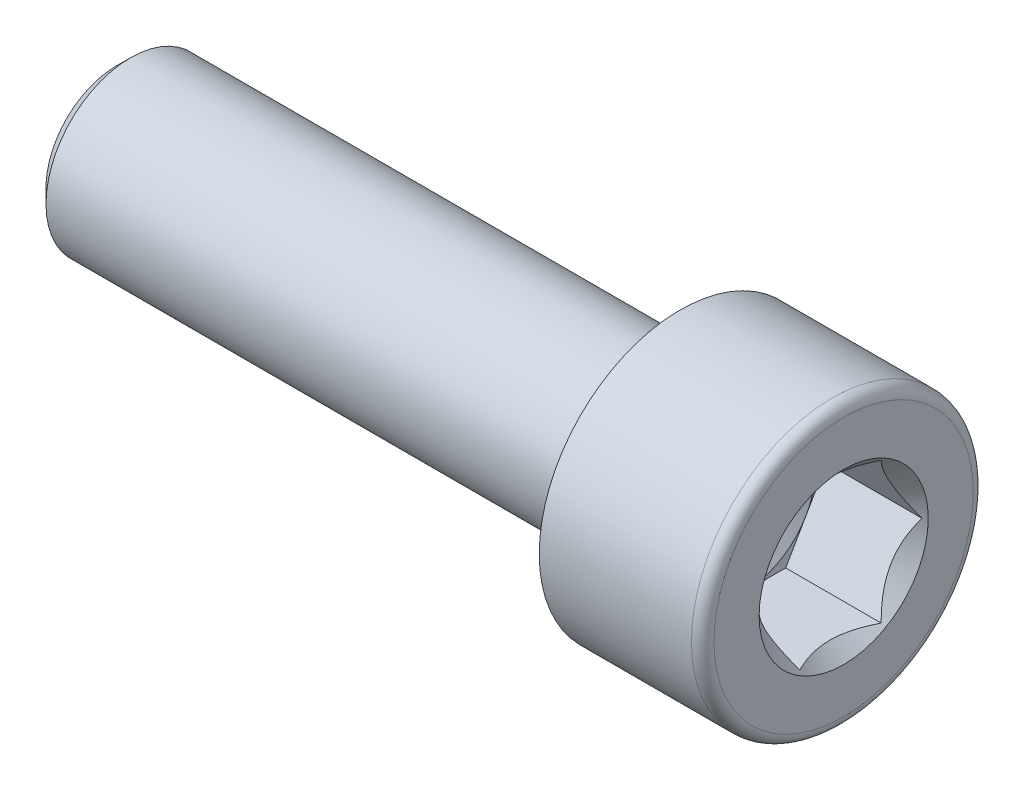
ISO-10303-21;
HEADER;
FILE_DESCRIPTION(('STEP AP214'),'2;1');
FILE_NAME('part.step','',(''),(''),'','','');
FILE_SCHEMA(('AUTOMOTIVE_DESIGN { 1 0 10303 214 1 1 1 1 }'));
ENDSEC;
DATA;
#1=APPLICATION_CONTEXT('core data for automotive mechanical design processes');
#2=APPLICATION_PROTOCOL_DEFINITION('international standard','automotive_design',2000,#1);
#3=PRODUCT_CONTEXT('',#1,'mechanical');
#4=PRODUCT('Part','Part','',(#3));
#5=PRODUCT_RELATED_PRODUCT_CATEGORY('part','',(#4));
#6=PRODUCT_DEFINITION_FORMATION('','',#4);
#7=PRODUCT_DEFINITION_CONTEXT('part definition',#1,'design');
#8=PRODUCT_DEFINITION('design','',#6,#7);
#9=PRODUCT_DEFINITION_SHAPE('','',#8);
#10=(LENGTH_UNIT() NAMED_UNIT(*) SI_UNIT(.MILLI.,.METRE.));
#11=(NAMED_UNIT(*) PLANE_ANGLE_UNIT() SI_UNIT($,.RADIAN.));
#12=(NAMED_UNIT(*) SI_UNIT($,.STERADIAN.) SOLID_ANGLE_UNIT());
#13=UNCERTAINTY_MEASURE_WITH_UNIT(LENGTH_MEASURE(1.E-05),#10,'distance_accuracy_value','');
#14=(GEOMETRIC_REPRESENTATION_CONTEXT(3) GLOBAL_UNCERTAINTY_ASSIGNED_CONTEXT((#13)) GLOBAL_UNIT_ASSIGNED_CONTEXT((#10,
#11,#12)) REPRESENTATION_CONTEXT('',''));
#15=CARTESIAN_POINT('',(0.,0.,0.));
#16=DIRECTION('',(0.,0.,1.));
#17=DIRECTION('',(1.,0.,0.));
#18=AXIS2_PLACEMENT_3D('',#15,#16,#17);
#19=CARTESIAN_POINT('',(-30.,0.,0.));
#20=DIRECTION('',(-1.,0.,0.));
#21=DIRECTION('',(0.,0.,1.));
#22=AXIS2_PLACEMENT_3D('',#19,#20,#21);
#23=CYLINDRICAL_SURFACE('',#22,3.);
#24=CARTESIAN_POINT('',(-19.5000000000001,0.,0.));
#25=DIRECTION('',(1.,0.,0.));
#26=DIRECTION('',(0.,0.,-1.));
#27=AXIS2_PLACEMENT_3D('',#24,#25,#26);
#28=CIRCLE('',#27,3.);
#29=CARTESIAN_POINT('',(-19.5000000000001,0.,-3.));
#30=VERTEX_POINT('',#29);
#31=EDGE_CURVE('E11',#30,#30,#28,.T.);
#32=ORIENTED_EDGE('',*,*,#31,.T.);
#33=EDGE_LOOP('',(#32));
#34=FACE_BOUND('',#33,.T.);
#35=CARTESIAN_POINT('',(0.,0.,0.));
#36=DIRECTION('',(-1.,0.,0.));
#37=DIRECTION('',(0.,0.,1.));
#38=AXIS2_PLACEMENT_3D('',#35,#36,#37);
#39=CIRCLE('',#38,3.);
#40=CARTESIAN_POINT('',(0.,0.,3.));
#41=VERTEX_POINT('',#40);
#42=EDGE_CURVE('E461',#41,#41,#39,.T.);
#43=ORIENTED_EDGE('',*,*,#42,.T.);
#44=EDGE_LOOP('',(#43));
#45=FACE_BOUND('',#44,.T.);
#46=ADVANCED_FACE('F348',(#34,#45),#23,.T.);
#47=CARTESIAN_POINT('',(-20.,0.,0.));
#48=DIRECTION('',(1.,0.,0.));
#49=DIRECTION('',(0.,0.,-1.));
#50=AXIS2_PLACEMENT_3D('',#47,#48,#49);
#51=PLANE('',#50);
#52=CARTESIAN_POINT('',(-20.,0.,0.));
#53=DIRECTION('',(1.,0.,0.));
#54=DIRECTION('',(0.,0.,-1.));
#55=AXIS2_PLACEMENT_3D('',#52,#53,#54);
#56=CIRCLE('',#55,2.5);
#57=CARTESIAN_POINT('',(-20.,0.,-2.5));
#58=VERTEX_POINT('',#57);
#59=EDGE_CURVE('E355',#58,#58,#56,.F.);
#60=ORIENTED_EDGE('',*,*,#59,.T.);
#61=EDGE_LOOP('',(#60));
#62=FACE_BOUND('',#61,.T.);
#63=ADVANCED_FACE('F535',(#62),#51,.F.);
#64=CARTESIAN_POINT('',(5.30000000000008,0.,0.));
#65=DIRECTION('',(1.,0.,0.));
#66=DIRECTION('',(0.,0.,-1.));
#67=AXIS2_PLACEMENT_3D('',#64,#65,#66);
#68=CONICAL_SURFACE('',#67,2.5,0.785398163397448);
#69=CARTESIAN_POINT('',(5.80000000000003,0.,0.));
#70=DIRECTION('',(-1.,0.,0.));
#71=DIRECTION('',(0.,0.,1.));
#72=AXIS2_PLACEMENT_3D('',#69,#70,#71);
#73=CIRCLE('',#72,3.);
#74=CARTESIAN_POINT('',(5.80000000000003,0.,3.));
#75=VERTEX_POINT('',#74);
#76=EDGE_CURVE('E484',#75,#75,#73,.T.);
#77=ORIENTED_EDGE('',*,*,#76,.F.);
#78=EDGE_LOOP('',(#77));
#79=FACE_BOUND('',#78,.T.);
#80=CARTESIAN_POINT('',(5.68686682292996,-2.50020000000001,1.44326020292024));
#81=CARTESIAN_POINT('',(5.63729205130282,-2.41426172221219,1.49287669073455));
#82=CARTESIAN_POINT('',(5.59062882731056,-2.32688643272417,1.54332283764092));
#83=CARTESIAN_POINT('',(5.50518948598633,-2.14871854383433,1.6461881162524));
#84=CARTESIAN_POINT('',(5.46646090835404,-2.05790899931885,1.69861703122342));
#85=CARTESIAN_POINT('',(5.40011804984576,-1.874795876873,1.80433744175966));
#86=CARTESIAN_POINT('',(5.37233701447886,-1.78253893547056,1.85760201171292));
#87=CARTESIAN_POINT('',(5.32953452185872,-1.59599399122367,1.96530378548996));
#88=CARTESIAN_POINT('',(5.31448111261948,-1.50171168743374,2.01973769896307));
#89=CARTESIAN_POINT('',(5.30089906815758,-1.33922174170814,2.11355131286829));
#90=CARTESIAN_POINT('',(5.29888844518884,-1.27122403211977,2.15280980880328));
#91=CARTESIAN_POINT('',(5.30227546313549,-1.13533975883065,2.23126263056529));
#92=CARTESIAN_POINT('',(5.30767570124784,-1.06745324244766,2.27045692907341));
#93=CARTESIAN_POINT('',(5.32557713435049,-0.932321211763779,2.34847544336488));
#94=CARTESIAN_POINT('',(5.33808627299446,-0.865076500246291,2.38729919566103));
#95=CARTESIAN_POINT('',(5.36951884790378,-0.731749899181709,2.46427534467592));
#96=CARTESIAN_POINT('',(5.38844179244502,-0.66566792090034,2.50242779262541));
#97=CARTESIAN_POINT('',(5.44461870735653,-0.496403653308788,2.60015256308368));
#98=CARTESIAN_POINT('',(5.48610717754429,-0.394270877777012,2.65911894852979));
#99=CARTESIAN_POINT('',(5.55614539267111,-0.244093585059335,2.7458238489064));
#100=CARTESIAN_POINT('',(5.5807535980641,-0.194603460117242,2.77439698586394));
#101=CARTESIAN_POINT('',(5.63221323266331,-0.0965399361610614,2.8310139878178));
#102=CARTESIAN_POINT('',(5.65906328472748,-0.0479659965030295,2.85905816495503));
#103=CARTESIAN_POINT('',(5.68686682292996,0.000199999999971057,2.88686681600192));
#104=B_SPLINE_CURVE_WITH_KNOTS('',3,(#80,#81,#82,#83,#84,#85,#86,#87,#88,#89,#90,#91,#92,#93,
#94,#95,#96,#97,#98,#99,#100,#101,#102,#103),.UNSPECIFIED.,.F.,.F.,(4,2,2,2,2,2,2,2,2,2,2,4),
(0.,0.333012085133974,0.667964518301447,0.997597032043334,1.32639954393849,1.56169424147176,
1.7970714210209,2.03271213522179,2.26833478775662,2.64260240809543,2.82922877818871,
3.01574133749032),.UNSPECIFIED.);
#105=CARTESIAN_POINT('',(5.6867513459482,-2.50000000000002,1.44337567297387));
#106=VERTEX_POINT('',#105);
#107=CARTESIAN_POINT('',(5.6867513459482,0.,2.8867513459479));
#108=VERTEX_POINT('',#107);
#109=EDGE_CURVE('E489',#106,#108,#104,.T.);
#110=ORIENTED_EDGE('',*,*,#109,.T.);
#111=CARTESIAN_POINT('',(5.68686682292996,-0.000199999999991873,2.88686681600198));
#112=CARTESIAN_POINT('',(5.63729205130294,0.085738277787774,2.83725032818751));
#113=CARTESIAN_POINT('',(5.59062882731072,0.173113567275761,2.78680418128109));
#114=CARTESIAN_POINT('',(5.5051894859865,0.351281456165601,2.68393890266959));
#115=CARTESIAN_POINT('',(5.4664609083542,0.442091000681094,2.63150998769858));
#116=CARTESIAN_POINT('',(5.40011804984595,0.625204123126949,2.52578957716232));
#117=CARTESIAN_POINT('',(5.37233701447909,0.71746106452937,2.47252500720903));
#118=CARTESIAN_POINT('',(5.32953452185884,0.904006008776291,2.36482323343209));
#119=CARTESIAN_POINT('',(5.31448111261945,0.998288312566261,2.3103893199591));
#120=CARTESIAN_POINT('',(5.30089906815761,1.16077825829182,2.21657570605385));
#121=CARTESIAN_POINT('',(5.29888844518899,1.22877596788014,2.17731721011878));
#122=CARTESIAN_POINT('',(5.30227546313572,1.36466024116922,2.0988643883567));
#123=CARTESIAN_POINT('',(5.30767570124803,1.43254675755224,2.05967008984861));
#124=CARTESIAN_POINT('',(5.32557713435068,1.56767878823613,1.98165157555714));
#125=CARTESIAN_POINT('',(5.33808627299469,1.6349234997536,1.94282782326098));
#126=CARTESIAN_POINT('',(5.36951884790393,1.76825010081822,1.86585167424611));
#127=CARTESIAN_POINT('',(5.38844179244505,1.83433207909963,1.82769922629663));
#128=CARTESIAN_POINT('',(5.44461870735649,2.00359634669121,1.72997445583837));
#129=CARTESIAN_POINT('',(5.48610717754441,2.10572912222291,1.67100807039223));
#130=CARTESIAN_POINT('',(5.55614539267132,2.25590641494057,1.58430317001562));
#131=CARTESIAN_POINT('',(5.58075359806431,2.30539653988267,1.55573003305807));
#132=CARTESIAN_POINT('',(5.63221323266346,2.40346006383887,1.4991130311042));
#133=CARTESIAN_POINT('',(5.65906328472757,2.45203400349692,1.47106885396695));
#134=CARTESIAN_POINT('',(5.68686682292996,2.50019999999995,1.44326020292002));
#135=B_SPLINE_CURVE_WITH_KNOTS('',3,(#111,#112,#113,#114,#115,#116,#117,#118,#119,#120,#121,
#122,#123,#124,#125,#126,#127,#128,#129,#130,#131,#132,#133,#134),.UNSPECIFIED.,.F.,.F.,(4,2,2,
2,2,2,2,2,2,2,2,4),(0.,0.333012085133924,0.667964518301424,0.997597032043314,1.32639954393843,
1.56169424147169,1.79707142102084,2.03271213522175,2.26833478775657,2.64260240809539,
2.82922877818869,3.0157413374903),.UNSPECIFIED.);
#136=CARTESIAN_POINT('',(5.6867513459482,2.49999999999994,1.44337567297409));
#137=VERTEX_POINT('',#136);
#138=EDGE_CURVE('E370',#108,#137,#135,.T.);
#139=ORIENTED_EDGE('',*,*,#138,.T.);
#140=CARTESIAN_POINT('',(6.74994835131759,2.49999999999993,-3.05811902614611));
#141=CARTESIAN_POINT('',(6.69289416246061,2.49999999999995,-2.98440983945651));
#142=CARTESIAN_POINT('',(6.636338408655,2.49999999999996,-2.91030875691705));
#143=CARTESIAN_POINT('',(6.52445299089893,2.49999999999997,-2.76116077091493));
#144=CARTESIAN_POINT('',(6.4691236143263,2.49999999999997,-2.6861136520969));
#145=CARTESIAN_POINT('',(6.35952665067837,2.49999999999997,-2.53436379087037));
#146=CARTESIAN_POINT('',(6.30527051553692,2.49999999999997,-2.4576527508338));
#147=CARTESIAN_POINT('',(6.19860260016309,2.49999999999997,-2.30296317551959));
#148=CARTESIAN_POINT('',(6.14619069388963,2.49999999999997,-2.22498472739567));
#149=CARTESIAN_POINT('',(6.04026321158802,2.49999999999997,-2.06236769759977));
#150=CARTESIAN_POINT('',(5.98690162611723,2.49999999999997,-1.97762830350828));
#151=CARTESIAN_POINT('',(5.88344307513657,2.49999999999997,-1.80618229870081));
#152=CARTESIAN_POINT('',(5.83334568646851,2.49999999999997,-1.71947594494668));
#153=CARTESIAN_POINT('',(5.73745253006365,2.49999999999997,-1.54402392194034));
#154=CARTESIAN_POINT('',(5.69164475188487,2.49999999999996,-1.45528486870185));
#155=CARTESIAN_POINT('',(5.60536574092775,2.49999999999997,-1.27526975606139));
#156=CARTESIAN_POINT('',(5.56489195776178,2.49999999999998,-1.18399493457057));
#157=CARTESIAN_POINT('',(5.49462825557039,2.49999999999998,-1.00836471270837));
#158=CARTESIAN_POINT('',(5.46416406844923,2.49999999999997,-0.924281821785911));
#159=CARTESIAN_POINT('',(5.4099624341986,2.49999999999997,-0.753934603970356));
#160=CARTESIAN_POINT('',(5.38622540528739,2.49999999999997,-0.667670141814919));
#161=CARTESIAN_POINT('',(5.34717521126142,2.49999999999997,-0.495001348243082));
#162=CARTESIAN_POINT('',(5.33170602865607,2.49999999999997,-0.408632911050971));
#163=CARTESIAN_POINT('',(5.30952108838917,2.49999999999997,-0.23477275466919));
#164=CARTESIAN_POINT('',(5.30280339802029,2.49999999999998,-0.147281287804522));
#165=CARTESIAN_POINT('',(5.29871822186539,2.49999999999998,0.0238518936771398));
#166=CARTESIAN_POINT('',(5.30093086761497,2.49999999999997,0.107483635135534));
#167=CARTESIAN_POINT('',(5.31360968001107,2.49999999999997,0.274114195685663));
#168=CARTESIAN_POINT('',(5.32407657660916,2.49999999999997,0.357112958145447));
#169=CARTESIAN_POINT('',(5.35284213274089,2.49999999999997,0.523288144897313));
#170=CARTESIAN_POINT('',(5.37128080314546,2.49999999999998,0.606439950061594));
#171=CARTESIAN_POINT('',(5.41495620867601,2.49999999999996,0.770896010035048));
#172=CARTESIAN_POINT('',(5.44019262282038,2.49999999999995,0.852200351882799));
#173=CARTESIAN_POINT('',(5.52700067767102,2.49999999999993,1.10064624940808));
#174=CARTESIAN_POINT('',(5.59813375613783,2.49999999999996,1.26445670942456));
#175=CARTESIAN_POINT('',(5.71682012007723,2.49999999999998,1.50421272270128));
#176=CARTESIAN_POINT('',(5.75847161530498,2.49999999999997,1.5832841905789));
#177=CARTESIAN_POINT('',(5.84501240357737,2.49999999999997,1.73963927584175));
#178=CARTESIAN_POINT('',(5.88990113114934,2.49999999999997,1.81692320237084));
#179=CARTESIAN_POINT('',(5.97999121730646,2.49999999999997,1.96613896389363));
#180=CARTESIAN_POINT('',(6.02506807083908,2.49999999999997,2.03814682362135));
#181=CARTESIAN_POINT('',(6.11714731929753,2.49999999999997,2.18092679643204));
#182=CARTESIAN_POINT('',(6.16414985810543,2.49999999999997,2.25169881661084));
#183=CARTESIAN_POINT('',(6.25935501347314,2.49999999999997,2.39159945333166));
#184=CARTESIAN_POINT('',(6.30754501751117,2.49999999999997,2.46073668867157));
#185=CARTESIAN_POINT('',(6.40522114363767,2.49999999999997,2.5980618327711));
#186=CARTESIAN_POINT('',(6.45470690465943,2.49999999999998,2.666249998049));
#187=CARTESIAN_POINT('',(6.50472334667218,2.49999999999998,2.73404006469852));
#188=B_SPLINE_CURVE_WITH_KNOTS('',3,(#140,#141,#142,#143,#144,#145,#146,#147,#148,#149,#150,
#151,#152,#153,#154,#155,#156,#157,#158,#159,#160,#161,#162,#163,#164,#165,#166,#167,#168,#169,
#170,#171,#172,#173,#174,#175,#176,#177,#178,#179,#180,#181,#182,#183,#184,#185,#186,#187),
.UNSPECIFIED.,.F.,.F.,(4,2,2,2,2,2,2,2,2,2,2,2,2,2,2,2,2,2,2,2,2,2,2,4),(0.,0.279636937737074,
0.55933872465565,0.841193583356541,1.12302914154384,1.42339426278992,1.7237203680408,
2.02317874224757,2.32249341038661,2.5905581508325,2.85863955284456,3.12146553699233,
3.38423346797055,3.63479445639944,3.88537760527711,4.14055298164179,4.39571631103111,
4.92983151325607,5.1979207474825,5.46596326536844,5.72079181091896,5.97563943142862,
6.22844778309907,6.48118642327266),.UNSPECIFIED.);
#189=CARTESIAN_POINT('',(5.6867513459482,2.49999999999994,-1.4433756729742));
#190=VERTEX_POINT('',#189);
#191=EDGE_CURVE('E526',#137,#190,#188,.F.);
#192=ORIENTED_EDGE('',*,*,#191,.T.);
#193=CARTESIAN_POINT('',(5.68686682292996,2.50019999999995,-1.44326020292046));
#194=CARTESIAN_POINT('',(5.63729205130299,2.41426172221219,-1.4928766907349));
#195=CARTESIAN_POINT('',(5.59062882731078,2.32688643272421,-1.54332283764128));
#196=CARTESIAN_POINT('',(5.50518948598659,2.1487185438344,-1.64618811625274));
#197=CARTESIAN_POINT('',(5.46646090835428,2.05790899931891,-1.69861703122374));
#198=CARTESIAN_POINT('',(5.40011804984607,1.87479587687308,-1.80433744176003));
#199=CARTESIAN_POINT('',(5.37233701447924,1.78253893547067,-1.85760201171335));
#200=CARTESIAN_POINT('',(5.32953452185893,1.59599399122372,-1.96530378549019));
#201=CARTESIAN_POINT('',(5.31448111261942,1.50171168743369,-2.01973769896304));
#202=CARTESIAN_POINT('',(5.30089906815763,1.33922174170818,-2.11355131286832));
#203=CARTESIAN_POINT('',(5.2988884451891,1.27122403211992,-2.15280980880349));
#204=CARTESIAN_POINT('',(5.30227546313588,1.13533975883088,-2.23126263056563));
#205=CARTESIAN_POINT('',(5.30767570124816,1.06745324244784,-2.27045692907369));
#206=CARTESIAN_POINT('',(5.32557713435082,0.932321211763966,-2.34847544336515));
#207=CARTESIAN_POINT('',(5.33808627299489,0.865076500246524,-2.38729919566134));
#208=CARTESIAN_POINT('',(5.36951884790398,0.731749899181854,-2.46427534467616));
#209=CARTESIAN_POINT('',(5.38844179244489,0.665667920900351,-2.50242779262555));
#210=CARTESIAN_POINT('',(5.44461870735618,0.496403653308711,-2.60015256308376));
#211=CARTESIAN_POINT('',(5.48610717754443,0.394270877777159,-2.65911894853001));
#212=CARTESIAN_POINT('',(5.55614539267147,0.244093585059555,-2.74582384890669));
#213=CARTESIAN_POINT('',(5.58075359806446,0.194603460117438,-2.77439698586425));
#214=CARTESIAN_POINT('',(5.63221323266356,0.0965399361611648,-2.83101398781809));
#215=CARTESIAN_POINT('',(5.65906328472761,0.0479659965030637,-2.85905816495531));
#216=CARTESIAN_POINT('',(5.68686682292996,-0.000200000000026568,-2.8868668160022));
#217=B_SPLINE_CURVE_WITH_KNOTS('',3,(#193,#194,#195,#196,#197,#198,#199,#200,#201,#202,#203,
#204,#205,#206,#207,#208,#209,#210,#211,#212,#213,#214,#215,#216),.UNSPECIFIED.,.F.,.F.,(4,2,2,
2,2,2,2,2,2,2,2,4),(0.,0.333012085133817,0.667964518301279,0.997597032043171,1.32639954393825,
1.56169424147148,1.79707142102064,2.03271213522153,2.2683347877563,2.64260240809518,
2.82922877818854,3.01574133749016),.UNSPECIFIED.);
#218=CARTESIAN_POINT('',(5.6867513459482,0.,-2.88675134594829));
#219=VERTEX_POINT('',#218);
#220=EDGE_CURVE('E609',#190,#219,#217,.T.);
#221=ORIENTED_EDGE('',*,*,#220,.T.);
#222=CARTESIAN_POINT('',(5.68686682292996,0.000199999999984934,-2.88686681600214));
#223=CARTESIAN_POINT('',(5.63729205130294,-0.0857382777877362,-2.83725032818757));
#224=CARTESIAN_POINT('',(5.59062882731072,-0.173113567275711,-2.78680418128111));
#225=CARTESIAN_POINT('',(5.5051894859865,-0.351281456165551,-2.68393890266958));
#226=CARTESIAN_POINT('',(5.46646090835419,-0.442091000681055,-2.63150998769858));
#227=CARTESIAN_POINT('',(5.40011804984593,-0.625204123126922,-2.52578957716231));
#228=CARTESIAN_POINT('',(5.37233701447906,-0.717461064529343,-2.47252500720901));
#229=CARTESIAN_POINT('',(5.32953452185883,-0.904006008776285,-2.36482323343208));
#230=CARTESIAN_POINT('',(5.31448111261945,-0.998288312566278,-2.31038931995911));
#231=CARTESIAN_POINT('',(5.30089906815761,-1.16077825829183,-2.21657570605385));
#232=CARTESIAN_POINT('',(5.29888844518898,-1.22877596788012,-2.17731721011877));
#233=CARTESIAN_POINT('',(5.3022754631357,-1.36466024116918,-2.0988643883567));
#234=CARTESIAN_POINT('',(5.30767570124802,-1.43254675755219,-2.05967008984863));
#235=CARTESIAN_POINT('',(5.32557713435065,-1.56767878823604,-1.98165157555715));
#236=CARTESIAN_POINT('',(5.33808627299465,-1.63492349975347,-1.94282782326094));
#237=CARTESIAN_POINT('',(5.3695188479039,-1.76825010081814,-1.86585167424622));
#238=CARTESIAN_POINT('',(5.38844179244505,-1.83433207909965,-1.82769922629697));
#239=CARTESIAN_POINT('',(5.4446187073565,-2.00359634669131,-1.72997445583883));
#240=CARTESIAN_POINT('',(5.48610717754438,-2.10572912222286,-1.67100807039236));
#241=CARTESIAN_POINT('',(5.55614539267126,-2.25590641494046,-1.58430317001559));
#242=CARTESIAN_POINT('',(5.58075359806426,-2.30539653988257,-1.55573003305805));
#243=CARTESIAN_POINT('',(5.63221323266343,-2.40346006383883,-1.49911303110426));
#244=CARTESIAN_POINT('',(5.65906328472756,-2.45203400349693,-1.47106885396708));
#245=CARTESIAN_POINT('',(5.68686682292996,-2.50020000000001,-1.44326020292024));
#246=B_SPLINE_CURVE_WITH_KNOTS('',3,(#222,#223,#224,#225,#226,#227,#228,#229,#230,#231,#232,
#233,#234,#235,#236,#237,#238,#239,#240,#241,#242,#243,#244,#245),.UNSPECIFIED.,.F.,.F.,(4,2,2,
2,2,2,2,2,2,2,2,4),(0.,0.333012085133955,0.667964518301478,0.997597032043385,1.32639954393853,
1.56169424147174,1.79707142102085,2.03271213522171,2.26833478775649,2.64260240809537,
2.82922877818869,3.01574133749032),.UNSPECIFIED.);
#247=CARTESIAN_POINT('',(5.6867513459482,-2.50000000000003,-1.44337567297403));
#248=VERTEX_POINT('',#247);
#249=EDGE_CURVE('E610',#219,#248,#246,.T.);
#250=ORIENTED_EDGE('',*,*,#249,.T.);
#251=CARTESIAN_POINT('',(6.74994835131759,-2.49999999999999,-3.05811902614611));
#252=CARTESIAN_POINT('',(6.69289416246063,-2.50000000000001,-2.98440983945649));
#253=CARTESIAN_POINT('',(6.63633840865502,-2.50000000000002,-2.91030875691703));
#254=CARTESIAN_POINT('',(6.52445299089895,-2.50000000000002,-2.7611607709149));
#255=CARTESIAN_POINT('',(6.46912361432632,-2.50000000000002,-2.68611365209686));
#256=CARTESIAN_POINT('',(6.35952665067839,-2.50000000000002,-2.53436379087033));
#257=CARTESIAN_POINT('',(6.30527051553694,-2.50000000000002,-2.45765275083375));
#258=CARTESIAN_POINT('',(6.1986026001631,-2.50000000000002,-2.30296317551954));
#259=CARTESIAN_POINT('',(6.14619069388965,-2.50000000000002,-2.22498472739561));
#260=CARTESIAN_POINT('',(6.04026321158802,-2.50000000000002,-2.0623676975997));
#261=CARTESIAN_POINT('',(5.98690162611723,-2.50000000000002,-1.9776283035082));
#262=CARTESIAN_POINT('',(5.88344307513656,-2.50000000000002,-1.80618229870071));
#263=CARTESIAN_POINT('',(5.8333456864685,-2.50000000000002,-1.71947594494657));
#264=CARTESIAN_POINT('',(5.73745253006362,-2.50000000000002,-1.5440239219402));
#265=CARTESIAN_POINT('',(5.69164475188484,-2.50000000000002,-1.45528486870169));
#266=CARTESIAN_POINT('',(5.60536574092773,-2.50000000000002,-1.27526975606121));
#267=CARTESIAN_POINT('',(5.56489195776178,-2.50000000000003,-1.18399493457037));
#268=CARTESIAN_POINT('',(5.4946282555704,-2.50000000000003,-1.00836471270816));
#269=CARTESIAN_POINT('',(5.46416406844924,-2.50000000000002,-0.924281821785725));
#270=CARTESIAN_POINT('',(5.4099624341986,-2.50000000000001,-0.753934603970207));
#271=CARTESIAN_POINT('',(5.38622540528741,-2.50000000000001,-0.667670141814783));
#272=CARTESIAN_POINT('',(5.34717521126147,-2.50000000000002,-0.495001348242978));
#273=CARTESIAN_POINT('',(5.33170602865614,-2.50000000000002,-0.408632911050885));
#274=CARTESIAN_POINT('',(5.30952108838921,-2.50000000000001,-0.234772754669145));
#275=CARTESIAN_POINT('',(5.30280339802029,-2.49999999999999,-0.1472812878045));
#276=CARTESIAN_POINT('',(5.29871822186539,-2.5,0.023851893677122));
#277=CARTESIAN_POINT('',(5.30093086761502,-2.50000000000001,0.1074836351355));
#278=CARTESIAN_POINT('',(5.31360968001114,-2.50000000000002,0.274114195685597));
#279=CARTESIAN_POINT('',(5.32407657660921,-2.50000000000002,0.357112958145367));
#280=CARTESIAN_POINT('',(5.35284213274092,-2.50000000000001,0.523288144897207));
#281=CARTESIAN_POINT('',(5.37128080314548,-2.50000000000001,0.606439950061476));
#282=CARTESIAN_POINT('',(5.41495620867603,-2.50000000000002,0.770896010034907));
#283=CARTESIAN_POINT('',(5.44019262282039,-2.50000000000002,0.852200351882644));
#284=CARTESIAN_POINT('',(5.52700067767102,-2.50000000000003,1.10064624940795));
#285=CARTESIAN_POINT('',(5.59813375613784,-2.50000000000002,1.26445670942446));
#286=CARTESIAN_POINT('',(5.71682012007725,-2.50000000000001,1.50421272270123));
#287=CARTESIAN_POINT('',(5.75847161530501,-2.50000000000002,1.58328419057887));
#288=CARTESIAN_POINT('',(5.84501240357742,-2.50000000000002,1.73963927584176));
#289=CARTESIAN_POINT('',(5.8899011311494,-2.50000000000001,1.81692320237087));
#290=CARTESIAN_POINT('',(5.97999121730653,-2.50000000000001,1.96613896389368));
#291=CARTESIAN_POINT('',(6.02506807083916,-2.50000000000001,2.03814682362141));
#292=CARTESIAN_POINT('',(6.11714731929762,-2.50000000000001,2.18092679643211));
#293=CARTESIAN_POINT('',(6.16414985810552,-2.50000000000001,2.25169881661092));
#294=CARTESIAN_POINT('',(6.25935501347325,-2.50000000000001,2.39159945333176));
#295=CARTESIAN_POINT('',(6.30754501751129,-2.50000000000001,2.46073668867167));
#296=CARTESIAN_POINT('',(6.40522114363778,-2.50000000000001,2.59806183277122));
#297=CARTESIAN_POINT('',(6.45470690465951,-2.50000000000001,2.66624999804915));
#298=CARTESIAN_POINT('',(6.50472334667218,-2.50000000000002,2.73404006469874));
#299=B_SPLINE_CURVE_WITH_KNOTS('',3,(#251,#252,#253,#254,#255,#256,#257,#258,#259,#260,#261,
#262,#263,#264,#265,#266,#267,#268,#269,#270,#271,#272,#273,#274,#275,#276,#277,#278,#279,#280,
#281,#282,#283,#284,#285,#286,#287,#288,#289,#290,#291,#292,#293,#294,#295,#296,#297,#298),
.UNSPECIFIED.,.F.,.F.,(4,2,2,2,2,2,2,2,2,2,2,2,2,2,2,2,2,2,2,2,2,2,2,4),(0.,0.279636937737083,
0.559338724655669,0.841193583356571,1.12302914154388,1.42339426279,1.72372036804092,
2.02317874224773,2.3224934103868,2.59055815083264,2.85863955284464,3.12146553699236,
3.38423346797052,3.63479445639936,3.88537760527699,4.14055298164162,4.3957163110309,
4.92983151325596,5.19792074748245,5.46596326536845,5.720791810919,5.97563943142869,
6.22844778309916,6.48118642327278),.UNSPECIFIED.);
#300=EDGE_CURVE('E497',#248,#106,#299,.T.);
#301=ORIENTED_EDGE('',*,*,#300,.T.);
#302=EDGE_LOOP('',(#110,#139,#192,#221,#250,#301));
#303=FACE_BOUND('',#302,.T.);
#304=ADVANCED_FACE('F503',(#79,#303),#68,.F.);
#305=CARTESIAN_POINT('',(5.80000000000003,4.59999999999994,-2.22044604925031E-13));
#306=DIRECTION('',(-1.,0.,0.));
#307=DIRECTION('',(0.,0.,1.));
#308=AXIS2_PLACEMENT_3D('',#305,#306,#307);
#309=PLANE('',#308);
#310=CARTESIAN_POINT('',(5.80000000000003,0.,0.));
#311=DIRECTION('',(-1.,0.,0.));
#312=DIRECTION('',(0.,0.,1.));
#313=AXIS2_PLACEMENT_3D('',#310,#311,#312);
#314=CIRCLE('',#313,4.6);
#315=CARTESIAN_POINT('',(5.80000000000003,0.,4.6));
#316=VERTEX_POINT('',#315);
#317=EDGE_CURVE('E481',#316,#316,#314,.T.);
#318=ORIENTED_EDGE('',*,*,#317,.F.);
#319=EDGE_LOOP('',(#318));
#320=FACE_BOUND('',#319,.T.);
#321=ORIENTED_EDGE('',*,*,#76,.T.);
#322=EDGE_LOOP('',(#321));
#323=FACE_BOUND('',#322,.T.);
#324=ADVANCED_FACE('F568',(#320,#323),#309,.F.);
#325=CARTESIAN_POINT('',(5.40000000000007,0.,0.));
#326=DIRECTION('',(-1.,0.,0.));
#327=DIRECTION('',(0.,0.,1.));
#328=AXIS2_PLACEMENT_3D('',#325,#326,#327);
#329=TOROIDAL_SURFACE('',#328,4.6,0.4);
#330=CARTESIAN_POINT('',(5.40000000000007,0.,0.));
#331=DIRECTION('',(-1.,0.,0.));
#332=DIRECTION('',(0.,0.,1.));
#333=AXIS2_PLACEMENT_3D('',#330,#331,#332);
#334=CIRCLE('',#333,5.);
#335=CARTESIAN_POINT('',(5.40000000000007,0.,5.));
#336=VERTEX_POINT('',#335);
#337=EDGE_CURVE('E478',#336,#336,#334,.T.);
#338=ORIENTED_EDGE('',*,*,#337,.F.);
#339=EDGE_LOOP('',(#338));
#340=FACE_BOUND('',#339,.T.);
#341=ORIENTED_EDGE('',*,*,#317,.T.);
#342=EDGE_LOOP('',(#341));
#343=FACE_BOUND('',#342,.T.);
#344=ADVANCED_FACE('F563',(#340,#343),#329,.T.);
#345=CARTESIAN_POINT('',(-30.,0.,0.));
#346=DIRECTION('',(-1.,0.,0.));
#347=DIRECTION('',(0.,0.,1.));
#348=AXIS2_PLACEMENT_3D('',#345,#346,#347);
#349=CYLINDRICAL_SURFACE('',#348,5.);
#350=CARTESIAN_POINT('',(0.,0.,0.));
#351=DIRECTION('',(-1.,0.,0.));
#352=DIRECTION('',(0.,0.,1.));
#353=AXIS2_PLACEMENT_3D('',#350,#351,#352);
#354=CIRCLE('',#353,5.);
#355=CARTESIAN_POINT('',(0.,0.,5.));
#356=VERTEX_POINT('',#355);
#357=EDGE_CURVE('E475',#356,#356,#354,.T.);
#358=ORIENTED_EDGE('',*,*,#357,.F.);
#359=EDGE_LOOP('',(#358));
#360=FACE_BOUND('',#359,.T.);
#361=ORIENTED_EDGE('',*,*,#337,.T.);
#362=EDGE_LOOP('',(#361));
#363=FACE_BOUND('',#362,.T.);
#364=ADVANCED_FACE('F558',(#360,#363),#349,.T.);
#365=CARTESIAN_POINT('',(0.,2.99999999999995,-2.22044604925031E-13));
#366=DIRECTION('',(1.,0.,0.));
#367=DIRECTION('',(0.,0.,-1.));
#368=AXIS2_PLACEMENT_3D('',#365,#366,#367);
#369=PLANE('',#368);
#370=ORIENTED_EDGE('',*,*,#42,.F.);
#371=EDGE_LOOP('',(#370));
#372=FACE_BOUND('',#371,.T.);
#373=ORIENTED_EDGE('',*,*,#357,.T.);
#374=EDGE_LOOP('',(#373));
#375=FACE_BOUND('',#374,.T.);
#376=ADVANCED_FACE('F519',(#372,#375),#369,.F.);
#377=CARTESIAN_POINT('',(2.29999999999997,0.,2.8867513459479));
#378=DIRECTION('',(1.,0.,0.));
#379=DIRECTION('',(0.,0.,-1.));
#380=AXIS2_PLACEMENT_3D('',#377,#378,#379);
#381=PLANE('',#380);
#382=CARTESIAN_POINT('',(2.29999999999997,0.,0.));
#383=DIRECTION('',(-1.,0.,0.));
#384=DIRECTION('',(0.,0.,1.));
#385=AXIS2_PLACEMENT_3D('',#382,#383,#384);
#386=CIRCLE('',#385,2.5);
#387=CARTESIAN_POINT('',(2.29999999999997,-1.25,-2.16506350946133));
#388=VERTEX_POINT('',#387);
#389=CARTESIAN_POINT('',(2.29999999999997,-2.50000000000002,0.));
#390=VERTEX_POINT('',#389);
#391=EDGE_CURVE('E593',#388,#390,#386,.T.);
#392=ORIENTED_EDGE('',*,*,#391,.T.);
#393=DIRECTION('',(0.,0.,-1.));
#394=VECTOR('',#393,1.);
#395=CARTESIAN_POINT('',(2.29999999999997,-2.50000000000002,1.44337567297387));
#396=LINE('',#395,#394);
#397=CARTESIAN_POINT('',(2.29999999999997,-2.50000000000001,-1.44337567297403));
#398=VERTEX_POINT('',#397);
#399=EDGE_CURVE('E444',#390,#398,#396,.T.);
#400=ORIENTED_EDGE('',*,*,#399,.T.);
#401=DIRECTION('',(0.,0.866025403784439,-0.500000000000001));
#402=VECTOR('',#401,1.);
#403=CARTESIAN_POINT('',(2.29999999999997,-2.50000000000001,-1.44337567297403));
#404=LINE('',#403,#402);
#405=EDGE_CURVE('E451',#398,#388,#404,.T.);
#406=ORIENTED_EDGE('',*,*,#405,.T.);
#407=EDGE_LOOP('',(#392,#400,#406));
#408=FACE_BOUND('',#407,.T.);
#409=ADVANCED_FACE('F557',(#408),#381,.T.);
#410=CARTESIAN_POINT('',(2.29999999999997,-1.25000000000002,2.16506350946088));
#411=VERTEX_POINT('',#410);
#412=EDGE_CURVE('E588',#390,#411,#386,.T.);
#413=ORIENTED_EDGE('',*,*,#412,.T.);
#414=DIRECTION('',(0.,-0.866025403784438,-0.5));
#415=VECTOR('',#414,1.);
#416=CARTESIAN_POINT('',(2.29999999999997,0.,2.8867513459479));
#417=LINE('',#416,#415);
#418=CARTESIAN_POINT('',(2.29999999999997,-2.50000000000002,1.44337567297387));
#419=VERTEX_POINT('',#418);
#420=EDGE_CURVE('E443',#411,#419,#417,.T.);
#421=ORIENTED_EDGE('',*,*,#420,.T.);
#422=EDGE_CURVE('E446',#419,#390,#396,.T.);
#423=ORIENTED_EDGE('',*,*,#422,.T.);
#424=EDGE_LOOP('',(#413,#421,#423));
#425=FACE_BOUND('',#424,.T.);
#426=ADVANCED_FACE('F587',(#425),#381,.T.);
#427=CARTESIAN_POINT('',(2.29999999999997,1.24999999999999,2.16506350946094));
#428=VERTEX_POINT('',#427);
#429=EDGE_CURVE('E428',#411,#428,#386,.T.);
#430=ORIENTED_EDGE('',*,*,#429,.T.);
#431=DIRECTION('',(0.,-0.866025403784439,0.500000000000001));
#432=VECTOR('',#431,1.);
#433=CARTESIAN_POINT('',(2.29999999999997,2.49999999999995,1.44337567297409));
#434=LINE('',#433,#432);
#435=CARTESIAN_POINT('',(2.29999999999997,0.,2.8867513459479));
#436=VERTEX_POINT('',#435);
#437=EDGE_CURVE('E423',#428,#436,#434,.T.);
#438=ORIENTED_EDGE('',*,*,#437,.T.);
#439=EDGE_CURVE('E426',#436,#411,#417,.T.);
#440=ORIENTED_EDGE('',*,*,#439,.T.);
#441=EDGE_LOOP('',(#430,#438,#440));
#442=FACE_BOUND('',#441,.T.);
#443=ADVANCED_FACE('F424',(#442),#381,.T.);
#444=CARTESIAN_POINT('',(2.29999999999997,2.5,-2.22044604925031E-13));
#445=VERTEX_POINT('',#444);
#446=EDGE_CURVE('E487',#428,#445,#386,.T.);
#447=ORIENTED_EDGE('',*,*,#446,.T.);
#448=DIRECTION('',(0.,0.,1.));
#449=VECTOR('',#448,1.);
#450=CARTESIAN_POINT('',(2.29999999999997,2.49999999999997,-1.4433756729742));
#451=LINE('',#450,#449);
#452=CARTESIAN_POINT('',(2.29999999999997,2.49999999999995,1.44337567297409));
#453=VERTEX_POINT('',#452);
#454=EDGE_CURVE('E456',#445,#453,#451,.T.);
#455=ORIENTED_EDGE('',*,*,#454,.T.);
#456=EDGE_CURVE('E431',#453,#428,#434,.T.);
#457=ORIENTED_EDGE('',*,*,#456,.T.);
#458=EDGE_LOOP('',(#447,#455,#457));
#459=FACE_BOUND('',#458,.T.);
#460=ADVANCED_FACE('F605',(#459),#381,.T.);
#461=CARTESIAN_POINT('',(2.29999999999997,1.24999999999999,-2.16506350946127));
#462=VERTEX_POINT('',#461);
#463=EDGE_CURVE('E490',#445,#462,#386,.T.);
#464=ORIENTED_EDGE('',*,*,#463,.T.);
#465=DIRECTION('',(0.,0.866025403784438,0.5));
#466=VECTOR('',#465,1.);
#467=CARTESIAN_POINT('',(2.29999999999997,0.,-2.88675134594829));
#468=LINE('',#467,#466);
#469=CARTESIAN_POINT('',(2.29999999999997,2.49999999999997,-1.4433756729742));
#470=VERTEX_POINT('',#469);
#471=EDGE_CURVE('E454',#462,#470,#468,.T.);
#472=ORIENTED_EDGE('',*,*,#471,.T.);
#473=EDGE_CURVE('E438',#470,#445,#451,.T.);
#474=ORIENTED_EDGE('',*,*,#473,.T.);
#475=EDGE_LOOP('',(#464,#472,#474));
#476=FACE_BOUND('',#475,.T.);
#477=ADVANCED_FACE('F600',(#476),#381,.T.);
#478=EDGE_CURVE('E594',#462,#388,#386,.T.);
#479=ORIENTED_EDGE('',*,*,#478,.T.);
#480=CARTESIAN_POINT('',(2.29999999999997,0.,-2.88675134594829));
#481=VERTEX_POINT('',#480);
#482=EDGE_CURVE('E450',#388,#481,#404,.T.);
#483=ORIENTED_EDGE('',*,*,#482,.T.);
#484=EDGE_CURVE('E362',#481,#462,#468,.T.);
#485=ORIENTED_EDGE('',*,*,#484,.T.);
#486=EDGE_LOOP('',(#479,#483,#485));
#487=FACE_BOUND('',#486,.T.);
#488=ADVANCED_FACE('F518',(#487),#381,.T.);
#489=CARTESIAN_POINT('',(2.29999999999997,2.49999999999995,1.44337567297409));
#490=DIRECTION('',(0.,0.499999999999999,0.866025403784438));
#491=DIRECTION('',(0.,-0.866025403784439,0.500000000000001));
#492=AXIS2_PLACEMENT_3D('',#489,#490,#491);
#493=PLANE('',#492);
#494=ORIENTED_EDGE('',*,*,#456,.F.);
#495=DIRECTION('',(1.,0.,0.));
#496=VECTOR('',#495,1.);
#497=CARTESIAN_POINT('',(2.29999999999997,2.49999999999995,1.44337567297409));
#498=LINE('',#497,#496);
#499=EDGE_CURVE('E459',#453,#137,#498,.T.);
#500=ORIENTED_EDGE('',*,*,#499,.T.);
#501=ORIENTED_EDGE('',*,*,#138,.F.);
#502=DIRECTION('',(1.,0.,0.));
#503=VECTOR('',#502,1.);
#504=CARTESIAN_POINT('',(2.29999999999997,0.,2.8867513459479));
#505=LINE('',#504,#503);
#506=EDGE_CURVE('E433',#436,#108,#505,.T.);
#507=ORIENTED_EDGE('',*,*,#506,.F.);
#508=ORIENTED_EDGE('',*,*,#437,.F.);
#509=EDGE_LOOP('',(#494,#500,#501,#507,#508));
#510=FACE_BOUND('',#509,.T.);
#511=ADVANCED_FACE('F434',(#510),#493,.F.);
#512=CARTESIAN_POINT('',(2.29999999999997,2.49999999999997,-1.4433756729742));
#513=DIRECTION('',(0.,1.,0.));
#514=DIRECTION('',(0.,0.,1.));
#515=AXIS2_PLACEMENT_3D('',#512,#513,#514);
#516=PLANE('',#515);
#517=ORIENTED_EDGE('',*,*,#473,.F.);
#518=DIRECTION('',(1.,0.,0.));
#519=VECTOR('',#518,1.);
#520=CARTESIAN_POINT('',(2.29999999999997,2.49999999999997,-1.4433756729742));
#521=LINE('',#520,#519);
#522=EDGE_CURVE('E462',#470,#190,#521,.T.);
#523=ORIENTED_EDGE('',*,*,#522,.T.);
#524=ORIENTED_EDGE('',*,*,#191,.F.);
#525=ORIENTED_EDGE('',*,*,#499,.F.);
#526=ORIENTED_EDGE('',*,*,#454,.F.);
#527=EDGE_LOOP('',(#517,#523,#524,#525,#526));
#528=FACE_BOUND('',#527,.T.);
#529=ADVANCED_FACE('F517',(#528),#516,.F.);
#530=CARTESIAN_POINT('',(2.29999999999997,0.,-2.88675134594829));
#531=DIRECTION('',(0.,0.500000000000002,-0.866025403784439));
#532=DIRECTION('',(0.,0.866025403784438,0.5));
#533=AXIS2_PLACEMENT_3D('',#530,#531,#532);
#534=PLANE('',#533);
#535=ORIENTED_EDGE('',*,*,#484,.F.);
#536=DIRECTION('',(1.,0.,0.));
#537=VECTOR('',#536,1.);
#538=CARTESIAN_POINT('',(2.29999999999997,0.,-2.88675134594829));
#539=LINE('',#538,#537);
#540=EDGE_CURVE('E465',#481,#219,#539,.T.);
#541=ORIENTED_EDGE('',*,*,#540,.T.);
#542=ORIENTED_EDGE('',*,*,#220,.F.);
#543=ORIENTED_EDGE('',*,*,#522,.F.);
#544=ORIENTED_EDGE('',*,*,#471,.F.);
#545=EDGE_LOOP('',(#535,#541,#542,#543,#544));
#546=FACE_BOUND('',#545,.T.);
#547=ADVANCED_FACE('F618',(#546),#534,.F.);
#548=CARTESIAN_POINT('',(2.29999999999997,-2.50000000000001,-1.44337567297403));
#549=DIRECTION('',(0.,-0.499999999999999,-0.866025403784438));
#550=DIRECTION('',(0.,0.866025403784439,-0.500000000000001));
#551=AXIS2_PLACEMENT_3D('',#548,#549,#550);
#552=PLANE('',#551);
#553=ORIENTED_EDGE('',*,*,#405,.F.);
#554=DIRECTION('',(1.,0.,0.));
#555=VECTOR('',#554,1.);
#556=CARTESIAN_POINT('',(2.29999999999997,-2.50000000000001,-1.44337567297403));
#557=LINE('',#556,#555);
#558=EDGE_CURVE('E468',#398,#248,#557,.T.);
#559=ORIENTED_EDGE('',*,*,#558,.T.);
#560=ORIENTED_EDGE('',*,*,#249,.F.);
#561=ORIENTED_EDGE('',*,*,#540,.F.);
#562=ORIENTED_EDGE('',*,*,#482,.F.);
#563=EDGE_LOOP('',(#553,#559,#560,#561,#562));
#564=FACE_BOUND('',#563,.T.);
#565=ADVANCED_FACE('F621',(#564),#552,.F.);
#566=CARTESIAN_POINT('',(2.29999999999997,-2.50000000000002,1.44337567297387));
#567=DIRECTION('',(0.,-1.,0.));
#568=DIRECTION('',(0.,0.,-1.));
#569=AXIS2_PLACEMENT_3D('',#566,#567,#568);
#570=PLANE('',#569);
#571=ORIENTED_EDGE('',*,*,#422,.F.);
#572=DIRECTION('',(1.,0.,0.));
#573=VECTOR('',#572,1.);
#574=CARTESIAN_POINT('',(2.29999999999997,-2.50000000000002,1.44337567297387));
#575=LINE('',#574,#573);
#576=EDGE_CURVE('E437',#419,#106,#575,.T.);
#577=ORIENTED_EDGE('',*,*,#576,.T.);
#578=ORIENTED_EDGE('',*,*,#300,.F.);
#579=ORIENTED_EDGE('',*,*,#558,.F.);
#580=ORIENTED_EDGE('',*,*,#399,.F.);
#581=EDGE_LOOP('',(#571,#577,#578,#579,#580));
#582=FACE_BOUND('',#581,.T.);
#583=ADVANCED_FACE('F511',(#582),#570,.F.);
#584=CARTESIAN_POINT('',(2.29999999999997,0.,2.8867513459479));
#585=DIRECTION('',(0.,-0.500000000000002,0.866025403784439));
#586=DIRECTION('',(0.,-0.866025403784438,-0.5));
#587=AXIS2_PLACEMENT_3D('',#584,#585,#586);
#588=PLANE('',#587);
#589=ORIENTED_EDGE('',*,*,#439,.F.);
#590=ORIENTED_EDGE('',*,*,#506,.T.);
#591=ORIENTED_EDGE('',*,*,#109,.F.);
#592=ORIENTED_EDGE('',*,*,#576,.F.);
#593=ORIENTED_EDGE('',*,*,#420,.F.);
#594=EDGE_LOOP('',(#589,#590,#591,#592,#593));
#595=FACE_BOUND('',#594,.T.);
#596=ADVANCED_FACE('F441',(#595),#588,.F.);
#597=CARTESIAN_POINT('',(0.856624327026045,0.,0.));
#598=DIRECTION('',(1.,0.,0.));
#599=DIRECTION('',(0.,0.,-1.));
#600=AXIS2_PLACEMENT_3D('',#597,#598,#599);
#601=CONICAL_SURFACE('',#600,0.,1.0471975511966);
#602=ORIENTED_EDGE('',*,*,#446,.F.);
#603=ORIENTED_EDGE('',*,*,#429,.F.);
#604=ORIENTED_EDGE('',*,*,#412,.F.);
#605=ORIENTED_EDGE('',*,*,#391,.F.);
#606=ORIENTED_EDGE('',*,*,#478,.F.);
#607=ORIENTED_EDGE('',*,*,#463,.F.);
#608=EDGE_LOOP('',(#602,#603,#604,#605,#606,#607));
#609=FACE_BOUND('',#608,.T.);
#610=CARTESIAN_POINT('',(0.856624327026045,0.,0.));
#611=VERTEX_POINT('',#610);
#612=VERTEX_LOOP('',#611);
#613=FACE_BOUND('',#612,.T.);
#614=ADVANCED_FACE('F510',(#609,#613),#601,.F.);
#615=CARTESIAN_POINT('',(-20.,0.,0.));
#616=DIRECTION('',(1.,0.,0.));
#617=DIRECTION('',(0.,0.,-1.));
#618=AXIS2_PLACEMENT_3D('',#615,#616,#617);
#619=CONICAL_SURFACE('',#618,2.5,0.785398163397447);
#620=ORIENTED_EDGE('',*,*,#31,.F.);
#621=EDGE_LOOP('',(#620));
#622=FACE_BOUND('',#621,.T.);
#623=ORIENTED_EDGE('',*,*,#59,.F.);
#624=EDGE_LOOP('',(#623));
#625=FACE_BOUND('',#624,.T.);
#626=ADVANCED_FACE('F537',(#622,#625),#619,.T.);
#627=CLOSED_SHELL('',(#46,#63,#304,#324,#344,#364,#376,#409,#426,#443,#460,#477,#488,#511,#529,
#547,#565,#583,#596,#614,#626));
#628=MANIFOLD_SOLID_BREP('B2',#627);
#629=ADVANCED_BREP_SHAPE_REPRESENTATION('',(#18,#628),#14);
#630=SHAPE_DEFINITION_REPRESENTATION(#9,#629);
ENDSEC;
END-ISO-10303-21;
